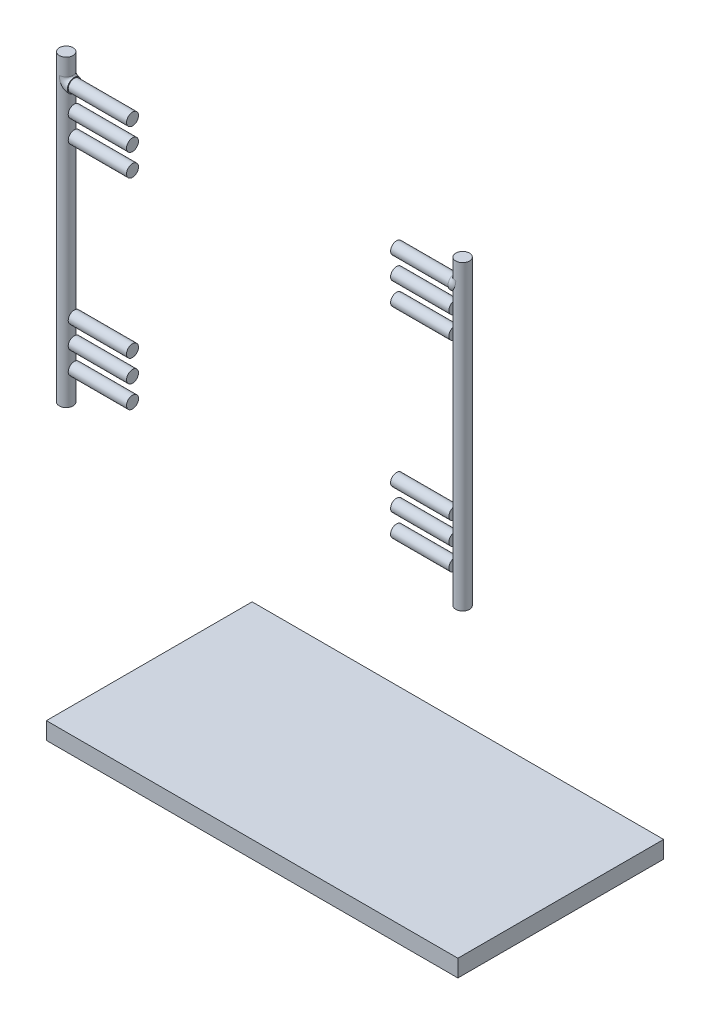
ISO-10303-21;
HEADER;
FILE_DESCRIPTION(('STEP AP214'),'2;1');
FILE_NAME('part.step','',(''),(''),'','','');
FILE_SCHEMA(('AUTOMOTIVE_DESIGN { 1 0 10303 214 1 1 1 1 }'));
ENDSEC;
DATA;
#1=APPLICATION_CONTEXT('core data for automotive mechanical design processes');
#2=APPLICATION_PROTOCOL_DEFINITION('international standard','automotive_design',2000,#1);
#3=PRODUCT_CONTEXT('',#1,'mechanical');
#4=PRODUCT('Part','Part','',(#3));
#5=PRODUCT_RELATED_PRODUCT_CATEGORY('part','',(#4));
#6=PRODUCT_DEFINITION_FORMATION('','',#4);
#7=PRODUCT_DEFINITION_CONTEXT('part definition',#1,'design');
#8=PRODUCT_DEFINITION('design','',#6,#7);
#9=PRODUCT_DEFINITION_SHAPE('','',#8);
#10=(LENGTH_UNIT() NAMED_UNIT(*) SI_UNIT(.MILLI.,.METRE.));
#11=(NAMED_UNIT(*) PLANE_ANGLE_UNIT() SI_UNIT($,.RADIAN.));
#12=(NAMED_UNIT(*) SI_UNIT($,.STERADIAN.) SOLID_ANGLE_UNIT());
#13=UNCERTAINTY_MEASURE_WITH_UNIT(LENGTH_MEASURE(1.E-05),#10,'distance_accuracy_value','');
#14=(GEOMETRIC_REPRESENTATION_CONTEXT(3) GLOBAL_UNCERTAINTY_ASSIGNED_CONTEXT((#13)) GLOBAL_UNIT_ASSIGNED_CONTEXT((#10,
#11,#12)) REPRESENTATION_CONTEXT('',''));
#15=CARTESIAN_POINT('',(0.,0.,0.));
#16=DIRECTION('',(0.,0.,1.));
#17=DIRECTION('',(1.,0.,0.));
#18=AXIS2_PLACEMENT_3D('',#15,#16,#17);
#19=CARTESIAN_POINT('',(-217.721189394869,-946.549259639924,33.515710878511));
#20=DIRECTION('',(1.,0.,0.));
#21=DIRECTION('',(0.,1.,0.));
#22=AXIS2_PLACEMENT_3D('',#19,#20,#21);
#23=PLANE('',#22);
#24=DIRECTION('',(0.,0.,-1.));
#25=VECTOR('',#24,1.);
#26=CARTESIAN_POINT('',(-217.721189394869,-896.549259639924,33.515710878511));
#27=LINE('',#26,#25);
#28=CARTESIAN_POINT('',(-217.721189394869,-896.549259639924,33.515710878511));
#29=VERTEX_POINT('',#28);
#30=CARTESIAN_POINT('',(-217.721189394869,-896.549259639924,-566.484289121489));
#31=VERTEX_POINT('',#30);
#32=EDGE_CURVE('E107',#29,#31,#27,.T.);
#33=ORIENTED_EDGE('',*,*,#32,.T.);
#34=DIRECTION('',(0.,1.,0.));
#35=VECTOR('',#34,1.);
#36=CARTESIAN_POINT('',(-217.721189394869,-946.549259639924,-566.484289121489));
#37=LINE('',#36,#35);
#38=CARTESIAN_POINT('',(-217.721189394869,-946.549259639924,-566.484289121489));
#39=VERTEX_POINT('',#38);
#40=EDGE_CURVE('E12',#39,#31,#37,.T.);
#41=ORIENTED_EDGE('',*,*,#40,.F.);
#42=DIRECTION('',(0.,0.,-1.));
#43=VECTOR('',#42,1.);
#44=CARTESIAN_POINT('',(-217.721189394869,-946.549259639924,33.515710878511));
#45=LINE('',#44,#43);
#46=CARTESIAN_POINT('',(-217.721189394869,-946.549259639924,33.515710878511));
#47=VERTEX_POINT('',#46);
#48=EDGE_CURVE('E95',#47,#39,#45,.T.);
#49=ORIENTED_EDGE('',*,*,#48,.F.);
#50=DIRECTION('',(0.,1.,0.));
#51=VECTOR('',#50,1.);
#52=CARTESIAN_POINT('',(-217.721189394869,-946.549259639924,33.515710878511));
#53=LINE('',#52,#51);
#54=EDGE_CURVE('E103',#47,#29,#53,.T.);
#55=ORIENTED_EDGE('',*,*,#54,.T.);
#56=EDGE_LOOP('',(#33,#41,#49,#55));
#57=FACE_BOUND('',#56,.T.);
#58=ADVANCED_FACE('F44',(#57),#23,.F.);
#59=CARTESIAN_POINT('',(-217.721189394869,-946.549259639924,-566.484289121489));
#60=DIRECTION('',(0.,0.,1.));
#61=DIRECTION('',(1.,0.,0.));
#62=AXIS2_PLACEMENT_3D('',#59,#60,#61);
#63=PLANE('',#62);
#64=DIRECTION('',(1.,0.,0.));
#65=VECTOR('',#64,1.);
#66=CARTESIAN_POINT('',(-217.721189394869,-896.549259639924,-566.484289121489));
#67=LINE('',#66,#65);
#68=CARTESIAN_POINT('',(982.278810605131,-896.549259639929,-566.484289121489));
#69=VERTEX_POINT('',#68);
#70=EDGE_CURVE('E99',#31,#69,#67,.T.);
#71=ORIENTED_EDGE('',*,*,#70,.T.);
#72=DIRECTION('',(0.,1.,0.));
#73=VECTOR('',#72,1.);
#74=CARTESIAN_POINT('',(982.278810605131,-946.549259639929,-566.484289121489));
#75=LINE('',#74,#73);
#76=CARTESIAN_POINT('',(982.278810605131,-946.549259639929,-566.484289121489));
#77=VERTEX_POINT('',#76);
#78=EDGE_CURVE('E52',#77,#69,#75,.T.);
#79=ORIENTED_EDGE('',*,*,#78,.F.);
#80=DIRECTION('',(1.,0.,0.));
#81=VECTOR('',#80,1.);
#82=CARTESIAN_POINT('',(-217.721189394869,-946.549259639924,-566.484289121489));
#83=LINE('',#82,#81);
#84=EDGE_CURVE('E90',#39,#77,#83,.T.);
#85=ORIENTED_EDGE('',*,*,#84,.F.);
#86=ORIENTED_EDGE('',*,*,#40,.T.);
#87=EDGE_LOOP('',(#71,#79,#85,#86));
#88=FACE_BOUND('',#87,.T.);
#89=ADVANCED_FACE('F98',(#88),#63,.F.);
#90=CARTESIAN_POINT('',(982.278810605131,-946.549259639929,33.515710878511));
#91=DIRECTION('',(-1.,0.,0.));
#92=DIRECTION('',(0.,-1.,0.));
#93=AXIS2_PLACEMENT_3D('',#90,#91,#92);
#94=PLANE('',#93);
#95=DIRECTION('',(0.,0.,1.));
#96=VECTOR('',#95,1.);
#97=CARTESIAN_POINT('',(982.278810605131,-896.549259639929,33.515710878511));
#98=LINE('',#97,#96);
#99=CARTESIAN_POINT('',(982.278810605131,-896.549259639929,33.515710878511));
#100=VERTEX_POINT('',#99);
#101=EDGE_CURVE('E77',#69,#100,#98,.T.);
#102=ORIENTED_EDGE('',*,*,#101,.T.);
#103=DIRECTION('',(0.,1.,0.));
#104=VECTOR('',#103,1.);
#105=CARTESIAN_POINT('',(982.278810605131,-946.549259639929,33.515710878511));
#106=LINE('',#105,#104);
#107=CARTESIAN_POINT('',(982.278810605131,-946.549259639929,33.515710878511));
#108=VERTEX_POINT('',#107);
#109=EDGE_CURVE('E100',#108,#100,#106,.T.);
#110=ORIENTED_EDGE('',*,*,#109,.F.);
#111=DIRECTION('',(0.,0.,1.));
#112=VECTOR('',#111,1.);
#113=CARTESIAN_POINT('',(982.278810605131,-946.549259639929,33.515710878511));
#114=LINE('',#113,#112);
#115=EDGE_CURVE('E93',#77,#108,#114,.T.);
#116=ORIENTED_EDGE('',*,*,#115,.F.);
#117=ORIENTED_EDGE('',*,*,#78,.T.);
#118=EDGE_LOOP('',(#102,#110,#116,#117));
#119=FACE_BOUND('',#118,.T.);
#120=ADVANCED_FACE('F101',(#119),#94,.F.);
#121=CARTESIAN_POINT('',(-217.721189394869,-946.549259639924,33.515710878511));
#122=DIRECTION('',(0.,0.,-1.));
#123=DIRECTION('',(-1.,0.,0.));
#124=AXIS2_PLACEMENT_3D('',#121,#122,#123);
#125=PLANE('',#124);
#126=DIRECTION('',(-1.,0.,0.));
#127=VECTOR('',#126,1.);
#128=CARTESIAN_POINT('',(-217.721189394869,-896.549259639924,33.515710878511));
#129=LINE('',#128,#127);
#130=EDGE_CURVE('E83',#100,#29,#129,.T.);
#131=ORIENTED_EDGE('',*,*,#130,.T.);
#132=ORIENTED_EDGE('',*,*,#54,.F.);
#133=DIRECTION('',(-1.,0.,0.));
#134=VECTOR('',#133,1.);
#135=CARTESIAN_POINT('',(-217.721189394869,-946.549259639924,33.515710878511));
#136=LINE('',#135,#134);
#137=EDGE_CURVE('E60',#108,#47,#136,.T.);
#138=ORIENTED_EDGE('',*,*,#137,.F.);
#139=ORIENTED_EDGE('',*,*,#109,.T.);
#140=EDGE_LOOP('',(#131,#132,#138,#139));
#141=FACE_BOUND('',#140,.T.);
#142=ADVANCED_FACE('F114',(#141),#125,.F.);
#143=CARTESIAN_POINT('',(-3.30496482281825E-12,-946.549259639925,0.));
#144=DIRECTION('',(0.,-1.,0.));
#145=DIRECTION('',(1.,0.,0.));
#146=AXIS2_PLACEMENT_3D('',#143,#144,#145);
#147=PLANE('',#146);
#148=ORIENTED_EDGE('',*,*,#48,.T.);
#149=ORIENTED_EDGE('',*,*,#84,.T.);
#150=ORIENTED_EDGE('',*,*,#115,.T.);
#151=ORIENTED_EDGE('',*,*,#137,.T.);
#152=EDGE_LOOP('',(#148,#149,#150,#151));
#153=FACE_BOUND('',#152,.T.);
#154=ADVANCED_FACE('F91',(#153),#147,.T.);
#155=CARTESIAN_POINT('',(-3.1303907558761E-12,-896.549259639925,0.));
#156=DIRECTION('',(0.,-1.,0.));
#157=DIRECTION('',(1.,0.,0.));
#158=AXIS2_PLACEMENT_3D('',#155,#156,#157);
#159=PLANE('',#158);
#160=ORIENTED_EDGE('',*,*,#32,.F.);
#161=ORIENTED_EDGE('',*,*,#130,.F.);
#162=ORIENTED_EDGE('',*,*,#101,.F.);
#163=ORIENTED_EDGE('',*,*,#70,.F.);
#164=EDGE_LOOP('',(#160,#161,#162,#163));
#165=FACE_BOUND('',#164,.T.);
#166=ADVANCED_FACE('F117',(#165),#159,.F.);
#167=CLOSED_SHELL('',(#58,#89,#120,#142,#154,#166));
#168=MANIFOLD_SOLID_BREP('B2',#167);
#169=CARTESIAN_POINT('',(940.,775.,0.));
#170=DIRECTION('',(-1.,0.,0.));
#171=DIRECTION('',(0.,0.,1.));
#172=AXIS2_PLACEMENT_3D('',#169,#170,#171);
#173=CYLINDRICAL_SURFACE('',#172,17.5);
#174=CARTESIAN_POINT('',(940.,775.,0.));
#175=DIRECTION('',(1.,0.,0.));
#176=DIRECTION('',(0.,0.,-1.));
#177=AXIS2_PLACEMENT_3D('',#174,#175,#176);
#178=CIRCLE('',#177,17.5);
#179=CARTESIAN_POINT('',(940.,775.,-17.5));
#180=VERTEX_POINT('',#179);
#181=EDGE_CURVE('E42',#180,#180,#178,.T.);
#182=ORIENTED_EDGE('',*,*,#181,.F.);
#183=EDGE_LOOP('',(#182));
#184=FACE_BOUND('',#183,.T.);
#185=CARTESIAN_POINT('',(770.,775.,0.));
#186=DIRECTION('',(1.,0.,0.));
#187=DIRECTION('',(0.,0.,-1.));
#188=AXIS2_PLACEMENT_3D('',#185,#186,#187);
#189=CIRCLE('',#188,17.5);
#190=CARTESIAN_POINT('',(770.,775.,-17.5));
#191=VERTEX_POINT('',#190);
#192=EDGE_CURVE('E178',#191,#191,#189,.T.);
#193=ORIENTED_EDGE('',*,*,#192,.T.);
#194=EDGE_LOOP('',(#193));
#195=FACE_BOUND('',#194,.T.);
#196=ADVANCED_FACE('F175',(#184,#195),#173,.T.);
#197=CARTESIAN_POINT('',(770.,775.,0.));
#198=DIRECTION('',(1.,0.,0.));
#199=DIRECTION('',(0.,0.,-1.));
#200=AXIS2_PLACEMENT_3D('',#197,#198,#199);
#201=PLANE('',#200);
#202=ORIENTED_EDGE('',*,*,#192,.F.);
#203=EDGE_LOOP('',(#202));
#204=FACE_BOUND('',#203,.T.);
#205=ADVANCED_FACE('F220',(#204),#201,.F.);
#206=CARTESIAN_POINT('',(940.,775.,0.));
#207=DIRECTION('',(1.,0.,0.));
#208=DIRECTION('',(0.,0.,-1.));
#209=AXIS2_PLACEMENT_3D('',#206,#207,#208);
#210=PLANE('',#209);
#211=CARTESIAN_POINT('',(940.,775.,0.));
#212=DIRECTION('',(1.,0.,0.));
#213=DIRECTION('',(0.,0.,-1.));
#214=AXIS2_PLACEMENT_3D('',#211,#212,#213);
#215=CIRCLE('',#214,20.);
#216=CARTESIAN_POINT('',(940.,775.,-20.));
#217=VERTEX_POINT('',#216);
#218=EDGE_CURVE('E194',#217,#217,#215,.T.);
#219=ORIENTED_EDGE('',*,*,#218,.F.);
#220=EDGE_LOOP('',(#219));
#221=FACE_BOUND('',#220,.T.);
#222=ORIENTED_EDGE('',*,*,#181,.T.);
#223=EDGE_LOOP('',(#222));
#224=FACE_BOUND('',#223,.T.);
#225=ADVANCED_FACE('F218',(#221,#224),#210,.F.);
#226=CARTESIAN_POINT('',(940.,797.631376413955,0.));
#227=DIRECTION('',(0.,0.,-1.));
#228=DIRECTION('',(-1.,0.,0.));
#229=AXIS2_PLACEMENT_3D('',#226,#227,#228);
#230=TOROIDAL_SURFACE('',#229,22.6313764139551,20.);
#231=CARTESIAN_POINT('',(962.631376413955,797.631376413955,0.));
#232=DIRECTION('',(0.,1.,0.));
#233=DIRECTION('',(0.,0.,-1.));
#234=AXIS2_PLACEMENT_3D('',#231,#232,#233);
#235=CIRCLE('',#234,20.);
#236=CARTESIAN_POINT('',(962.631376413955,797.631376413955,-20.0000000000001));
#237=VERTEX_POINT('',#236);
#238=CARTESIAN_POINT('',(962.631376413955,797.631376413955,20.0000000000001));
#239=VERTEX_POINT('',#238);
#240=EDGE_CURVE('E188',#237,#239,#235,.T.);
#241=ORIENTED_EDGE('',*,*,#240,.F.);
#242=CARTESIAN_POINT('',(962.631376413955,797.631376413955,-20.));
#243=CARTESIAN_POINT('',(962.631376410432,797.560459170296,-20.0000000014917));
#244=CARTESIAN_POINT('',(962.631209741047,797.489542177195,-20.000000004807));
#245=CARTESIAN_POINT('',(962.630557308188,797.350735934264,-19.9999999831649));
#246=CARTESIAN_POINT('',(962.63008546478,797.282846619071,-19.9999999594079));
#247=CARTESIAN_POINT('',(962.626962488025,796.943395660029,-19.9999997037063));
#248=CARTESIAN_POINT('',(962.622020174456,796.671851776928,-19.9999990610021));
#249=CARTESIAN_POINT('',(962.605502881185,796.064535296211,-19.9999854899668));
#250=CARTESIAN_POINT('',(962.592633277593,795.728797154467,-19.999969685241));
#251=CARTESIAN_POINT('',(962.561636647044,795.101925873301,-19.9998833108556));
#252=CARTESIAN_POINT('',(962.544426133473,794.810746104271,-19.9998202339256));
#253=CARTESIAN_POINT('',(962.484380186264,793.937325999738,-19.9995014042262));
#254=CARTESIAN_POINT('',(962.433143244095,793.355631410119,-19.9991159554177));
#255=CARTESIAN_POINT('',(962.339719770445,792.484853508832,-19.9978968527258));
#256=CARTESIAN_POINT('',(962.305811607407,792.194849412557,-19.9973835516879));
#257=CARTESIAN_POINT('',(962.232519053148,791.615507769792,-19.9960560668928));
#258=CARTESIAN_POINT('',(962.19313419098,791.326170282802,-19.9952418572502));
#259=CARTESIAN_POINT('',(962.065903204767,790.452855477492,-19.9921867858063));
#260=CARTESIAN_POINT('',(961.96967894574,789.87007961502,-19.9893384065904));
#261=CARTESIAN_POINT('',(961.755595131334,788.70848660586,-19.9811026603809));
#262=CARTESIAN_POINT('',(961.637733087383,788.129669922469,-19.9757150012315));
#263=CARTESIAN_POINT('',(961.380972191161,786.97651875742,-19.9612885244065));
#264=CARTESIAN_POINT('',(961.242065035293,786.402186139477,-19.9522482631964));
#265=CARTESIAN_POINT('',(960.943990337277,785.258889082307,-19.929250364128));
#266=CARTESIAN_POINT('',(960.784821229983,784.68992506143,-19.9152923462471));
#267=CARTESIAN_POINT('',(960.277116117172,782.988683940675,-19.8638816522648));
#268=CARTESIAN_POINT('',(959.899115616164,781.865320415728,-19.8169177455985));
#269=CARTESIAN_POINT('',(959.072292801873,779.647554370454,-19.6852212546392));
#270=CARTESIAN_POINT('',(958.623481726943,778.553147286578,-19.6004946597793));
#271=CARTESIAN_POINT('',(957.661485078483,776.392893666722,-19.3789789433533));
#272=CARTESIAN_POINT('',(957.148044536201,775.327181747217,-19.241978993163));
#273=CARTESIAN_POINT('',(956.067942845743,773.233546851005,-18.9008505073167));
#274=CARTESIAN_POINT('',(955.501266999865,772.205634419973,-18.6967033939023));
#275=CARTESIAN_POINT('',(954.32848781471,770.197304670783,-18.2061769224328));
#276=CARTESIAN_POINT('',(953.722521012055,769.216741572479,-17.9200716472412));
#277=CARTESIAN_POINT('',(952.48395013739,767.307956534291,-17.2489222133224));
#278=CARTESIAN_POINT('',(951.85136926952,766.37969058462,-16.8639628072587));
#279=CARTESIAN_POINT('',(950.869919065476,764.997831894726,-16.1816000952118));
#280=CARTESIAN_POINT('',(950.523984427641,764.521786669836,-15.9250096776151));
#281=CARTESIAN_POINT('',(949.833106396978,763.590424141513,-15.3752778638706));
#282=CARTESIAN_POINT('',(949.488162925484,763.135105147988,-15.0821394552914));
#283=CARTESIAN_POINT('',(948.803490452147,762.248145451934,-14.4569836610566));
#284=CARTESIAN_POINT('',(948.463759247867,761.81649453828,-14.124983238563));
#285=CARTESIAN_POINT('',(947.794103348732,760.979957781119,-13.4198228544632));
#286=CARTESIAN_POINT('',(947.464177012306,760.575067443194,-13.0466698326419));
#287=CARTESIAN_POINT('',(946.87775071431,759.866220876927,-12.3287319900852));
#288=CARTESIAN_POINT('',(946.618739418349,759.557230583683,-11.9909679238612));
#289=CARTESIAN_POINT('',(946.114369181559,758.96228159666,-11.2861076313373));
#290=CARTESIAN_POINT('',(945.869009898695,758.676322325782,-10.9190121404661));
#291=CARTESIAN_POINT('',(945.395943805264,758.130481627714,-10.1558462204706));
#292=CARTESIAN_POINT('',(945.168219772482,757.870574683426,-9.75980481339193));
#293=CARTESIAN_POINT('',(944.734235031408,757.379568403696,-8.93910755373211));
#294=CARTESIAN_POINT('',(944.527969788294,757.148462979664,-8.51445777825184));
#295=CARTESIAN_POINT('',(944.178569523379,756.759872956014,-7.72290074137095));
#296=CARTESIAN_POINT('',(944.030940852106,756.596794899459,-7.3607138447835));
#297=CARTESIAN_POINT('',(943.754646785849,756.293155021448,-6.62006186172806));
#298=CARTESIAN_POINT('',(943.625977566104,756.152588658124,-6.24160007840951));
#299=CARTESIAN_POINT('',(943.389779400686,755.895638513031,-5.47024467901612));
#300=CARTESIAN_POINT('',(943.282244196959,755.779247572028,-5.07735537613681));
#301=CARTESIAN_POINT('',(943.090245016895,755.572114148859,-4.27932117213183));
#302=CARTESIAN_POINT('',(943.005781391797,755.481372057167,-3.8741760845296));
#303=CARTESIAN_POINT('',(942.861226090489,755.326425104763,-3.05224097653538));
#304=CARTESIAN_POINT('',(942.801266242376,755.262363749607,-2.63540053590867));
#305=CARTESIAN_POINT('',(942.707644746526,755.162465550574,-1.79540740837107));
#306=CARTESIAN_POINT('',(942.673983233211,755.126628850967,-1.37225468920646));
#307=CARTESIAN_POINT('',(942.633708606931,755.083762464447,-0.523293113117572));
#308=CARTESIAN_POINT('',(942.62708989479,755.076726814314,-0.0974848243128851));
#309=CARTESIAN_POINT('',(942.641037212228,755.091564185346,0.753162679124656));
#310=CARTESIAN_POINT('',(942.661601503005,755.11343535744,1.17800195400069));
#311=CARTESIAN_POINT('',(942.726502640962,755.182585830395,1.98644543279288));
#312=CARTESIAN_POINT('',(942.76862658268,755.227500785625,2.37043451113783));
#313=CARTESIAN_POINT('',(942.874385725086,755.340540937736,3.1319432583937));
#314=CARTESIAN_POINT('',(942.938019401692,755.408664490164,3.50946338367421));
#315=CARTESIAN_POINT('',(943.085690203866,755.567265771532,4.25568226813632));
#316=CARTESIAN_POINT('',(943.169727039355,755.657743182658,4.62438115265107));
#317=CARTESIAN_POINT('',(943.356828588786,755.859993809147,5.35093971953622));
#318=CARTESIAN_POINT('',(943.459894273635,755.971768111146,5.70879884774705));
#319=CARTESIAN_POINT('',(943.687908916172,756.220230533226,6.42589634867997));
#320=CARTESIAN_POINT('',(943.813562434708,756.357729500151,6.78462893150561));
#321=CARTESIAN_POINT('',(944.08183530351,756.652987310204,7.48704839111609));
#322=CARTESIAN_POINT('',(944.224454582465,756.810746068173,7.83073533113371));
#323=CARTESIAN_POINT('',(944.5247591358,757.145099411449,8.50209852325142));
#324=CARTESIAN_POINT('',(944.682448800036,757.321699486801,8.82977006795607));
#325=CARTESIAN_POINT('',(945.010940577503,757.692257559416,9.46832775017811));
#326=CARTESIAN_POINT('',(945.181745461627,757.886219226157,9.77921031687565));
#327=CARTESIAN_POINT('',(945.621249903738,758.38929599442,10.5322295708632));
#328=CARTESIAN_POINT('',(945.896838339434,758.708191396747,10.9638651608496));
#329=CARTESIAN_POINT('',(946.467191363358,759.377187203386,11.7885856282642));
#330=CARTESIAN_POINT('',(946.761963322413,759.727299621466,12.1816555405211));
#331=CARTESIAN_POINT('',(947.365931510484,760.455512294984,12.9305052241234));
#332=CARTESIAN_POINT('',(947.675151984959,760.83366026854,13.2862188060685));
#333=CARTESIAN_POINT('',(948.302876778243,761.614060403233,13.9608899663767));
#334=CARTESIAN_POINT('',(948.621381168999,762.016312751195,14.2798472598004));
#335=CARTESIAN_POINT('',(949.406171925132,763.025405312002,15.0166051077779));
#336=CARTESIAN_POINT('',(949.875344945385,763.643852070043,15.4154962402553));
#337=CARTESIAN_POINT('',(950.814470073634,764.918411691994,16.1466761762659));
#338=CARTESIAN_POINT('',(951.284422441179,765.57454179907,16.4789341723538));
#339=CARTESIAN_POINT('',(952.217250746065,766.919863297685,17.0837744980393));
#340=CARTESIAN_POINT('',(952.680116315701,767.609097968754,17.3562759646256));
#341=CARTESIAN_POINT('',(953.591119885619,769.015499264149,17.8477336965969));
#342=CARTESIAN_POINT('',(954.039259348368,769.732663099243,18.0666952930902));
#343=CARTESIAN_POINT('',(954.991704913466,771.319408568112,18.491971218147));
#344=CARTESIAN_POINT('',(955.492122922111,772.193707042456,18.6893727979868));
#345=CARTESIAN_POINT('',(956.456788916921,773.972361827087,19.0298747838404));
#346=CARTESIAN_POINT('',(956.921029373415,774.876724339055,19.1729639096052));
#347=CARTESIAN_POINT('',(957.806036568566,776.711129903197,19.414589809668));
#348=CARTESIAN_POINT('',(958.226844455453,777.641147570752,19.5131690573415));
#349=CARTESIAN_POINT('',(959.01943223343,779.524477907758,19.6753000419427));
#350=CARTESIAN_POINT('',(959.391224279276,780.477784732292,19.7388604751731));
#351=CARTESIAN_POINT('',(960.100514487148,782.460813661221,19.8426480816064));
#352=CARTESIAN_POINT('',(960.434801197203,783.491773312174,19.8813193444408));
#353=CARTESIAN_POINT('',(960.886477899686,785.052481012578,19.9243079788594));
#354=CARTESIAN_POINT('',(961.028715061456,785.574961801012,19.936133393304));
#355=CARTESIAN_POINT('',(961.296072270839,786.624364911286,19.9558251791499));
#356=CARTESIAN_POINT('',(961.421192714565,787.151287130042,19.96369164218));
#357=CARTESIAN_POINT('',(961.681037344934,788.333189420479,19.9779270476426));
#358=CARTESIAN_POINT('',(961.811125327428,788.989204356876,19.9835114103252));
#359=CARTESIAN_POINT('',(962.043409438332,790.306103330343,19.9916924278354));
#360=CARTESIAN_POINT('',(962.145607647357,790.966987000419,19.9942893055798));
#361=CARTESIAN_POINT('',(962.343073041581,792.456290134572,19.9982269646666));
#362=CARTESIAN_POINT('',(962.430398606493,793.285785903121,19.9990992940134));
#363=CARTESIAN_POINT('',(962.534221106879,794.622861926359,19.9997995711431));
#364=CARTESIAN_POINT('',(962.565062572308,795.129372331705,19.9999026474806));
#365=CARTESIAN_POINT('',(962.600537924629,795.934191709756,19.9999804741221));
#366=CARTESIAN_POINT('',(962.610734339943,796.232260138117,19.9999906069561));
#367=CARTESIAN_POINT('',(962.62518678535,796.826425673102,20.0000003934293));
#368=CARTESIAN_POINT('',(962.629484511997,797.122521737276,20.0000001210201));
#369=CARTESIAN_POINT('',(962.631209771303,797.489542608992,19.999999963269));
#370=CARTESIAN_POINT('',(962.631376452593,797.560459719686,19.9999999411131));
#371=CARTESIAN_POINT('',(962.631376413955,797.631376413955,20.));
#372=B_SPLINE_CURVE_WITH_KNOTS('',3,(#242,#243,#244,#245,#246,#247,#248,#249,#250,#251,#252,
#253,#254,#255,#256,#257,#258,#259,#260,#261,#262,#263,#264,#265,#266,#267,#268,#269,#270,#271,
#272,#273,#274,#275,#276,#277,#278,#279,#280,#281,#282,#283,#284,#285,#286,#287,#288,#289,#290,
#291,#292,#293,#294,#295,#296,#297,#298,#299,#300,#301,#302,#303,#304,#305,#306,#307,#308,#309,
#310,#311,#312,#313,#314,#315,#316,#317,#318,#319,#320,#321,#322,#323,#324,#325,#326,#327,#328,
#329,#330,#331,#332,#333,#334,#335,#336,#337,#338,#339,#340,#341,#342,#343,#344,#345,#346,#347,
#348,#349,#350,#351,#352,#353,#354,#355,#356,#357,#358,#359,#360,#361,#362,#363,#364,#365,#366,
#367,#368,#369,#370,#371),.UNSPECIFIED.,.F.,.F.,(4,2,2,2,2,2,2,2,2,2,2,2,2,2,2,2,2,2,2,2,2,2,2,
2,2,2,2,2,2,2,2,2,2,2,2,2,2,2,2,2,2,2,2,2,2,2,2,2,2,2,2,2,2,2,2,2,2,2,2,2,2,2,2,2,4),(0.,
0.212751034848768,0.416423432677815,1.23114393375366,2.23900766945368,3.1140321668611,
4.86536057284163,5.74125985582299,6.61723450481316,8.38879453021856,10.1605584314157,
11.9330232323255,13.7056250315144,17.2608374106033,20.8154861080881,24.3846255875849,
27.954753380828,31.5130786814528,35.068363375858,36.993143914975,38.9177672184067,
40.8415535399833,42.7650159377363,44.3415866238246,45.9181177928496,47.4930894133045,
49.0677275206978,50.337766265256,51.6075484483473,52.8769540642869,54.1463790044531,
55.4225461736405,56.6987198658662,57.9746293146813,59.2504571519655,60.4157992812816,
61.5810588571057,62.7463018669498,63.9116043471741,65.1230194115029,66.3344293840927,
67.5461933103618,68.75821395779,70.5653297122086,72.3731439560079,74.1841091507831,
75.9950883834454,78.6093350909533,81.2247877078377,83.8437580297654,86.4624674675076,
89.5392685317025,92.6167082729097,95.6912051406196,98.7649381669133,102.015822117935,
103.640447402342,105.265035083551,107.270849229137,109.276513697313,111.777390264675,
113.299470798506,114.194145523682,115.082462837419,115.295213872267),.UNSPECIFIED.);
#373=EDGE_CURVE('E190',#237,#239,#372,.T.);
#374=ORIENTED_EDGE('',*,*,#373,.T.);
#375=EDGE_LOOP('',(#241,#374));
#376=FACE_BOUND('',#375,.T.);
#377=ORIENTED_EDGE('',*,*,#218,.T.);
#378=EDGE_LOOP('',(#377));
#379=FACE_BOUND('',#378,.T.);
#380=ADVANCED_FACE('F191',(#376,#379),#230,.T.);
#381=CARTESIAN_POINT('',(962.631376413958,-32.3686235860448,0.));
#382=DIRECTION('',(0.,1.,0.));
#383=DIRECTION('',(-1.,0.,0.));
#384=AXIS2_PLACEMENT_3D('',#381,#382,#383);
#385=CYLINDRICAL_SURFACE('',#384,20.0000000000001);
#386=CARTESIAN_POINT('',(962.631376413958,-32.3686235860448,0.));
#387=DIRECTION('',(0.,1.,0.));
#388=DIRECTION('',(-1.,0.,0.));
#389=AXIS2_PLACEMENT_3D('',#386,#387,#388);
#390=CIRCLE('',#389,20.0000000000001);
#391=CARTESIAN_POINT('',(942.631376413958,-32.3686235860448,0.));
#392=VERTEX_POINT('',#391);
#393=EDGE_CURVE('E195',#392,#392,#390,.T.);
#394=ORIENTED_EDGE('',*,*,#393,.T.);
#395=EDGE_LOOP('',(#394));
#396=FACE_BOUND('',#395,.T.);
#397=ORIENTED_EDGE('',*,*,#373,.F.);
#398=ORIENTED_EDGE('',*,*,#240,.T.);
#399=EDGE_LOOP('',(#397,#398));
#400=FACE_BOUND('',#399,.T.);
#401=CARTESIAN_POINT('',(962.631376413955,847.631376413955,0.));
#402=DIRECTION('',(0.,1.,0.));
#403=DIRECTION('',(-1.,0.,0.));
#404=AXIS2_PLACEMENT_3D('',#401,#402,#403);
#405=CIRCLE('',#404,20.0000000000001);
#406=CARTESIAN_POINT('',(942.631376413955,847.631376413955,0.));
#407=VERTEX_POINT('',#406);
#408=EDGE_CURVE('E279',#407,#407,#405,.T.);
#409=ORIENTED_EDGE('',*,*,#408,.F.);
#410=EDGE_LOOP('',(#409));
#411=FACE_BOUND('',#410,.T.);
#412=ADVANCED_FACE('F197',(#396,#400,#411),#385,.T.);
#413=CARTESIAN_POINT('',(962.631376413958,-32.3686235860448,0.));
#414=DIRECTION('',(0.,1.,0.));
#415=DIRECTION('',(-1.,0.,0.));
#416=AXIS2_PLACEMENT_3D('',#413,#414,#415);
#417=PLANE('',#416);
#418=ORIENTED_EDGE('',*,*,#393,.F.);
#419=EDGE_LOOP('',(#418));
#420=FACE_BOUND('',#419,.T.);
#421=ADVANCED_FACE('F215',(#420),#417,.F.);
#422=CARTESIAN_POINT('',(962.631376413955,847.631376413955,0.));
#423=DIRECTION('',(0.,1.,0.));
#424=DIRECTION('',(-1.,0.,0.));
#425=AXIS2_PLACEMENT_3D('',#422,#423,#424);
#426=PLANE('',#425);
#427=ORIENTED_EDGE('',*,*,#408,.T.);
#428=EDGE_LOOP('',(#427));
#429=FACE_BOUND('',#428,.T.);
#430=ADVANCED_FACE('F265',(#429),#426,.T.);
#431=CLOSED_SHELL('',(#196,#205,#225,#380,#412,#421,#430));
#432=MANIFOLD_SOLID_BREP('B6',#431);
#433=CARTESIAN_POINT('',(940.,710.,0.));
#434=DIRECTION('',(-1.,0.,0.));
#435=DIRECTION('',(0.,0.,1.));
#436=AXIS2_PLACEMENT_3D('',#433,#434,#435);
#437=CYLINDRICAL_SURFACE('',#436,17.5);
#438=CARTESIAN_POINT('',(940.,710.,0.));
#439=DIRECTION('',(1.,0.,0.));
#440=DIRECTION('',(0.,0.,-1.));
#441=AXIS2_PLACEMENT_3D('',#438,#439,#440);
#442=CIRCLE('',#441,17.5);
#443=CARTESIAN_POINT('',(940.,710.,-17.5));
#444=VERTEX_POINT('',#443);
#445=EDGE_CURVE('E174',#444,#444,#442,.T.);
#446=ORIENTED_EDGE('',*,*,#445,.F.);
#447=EDGE_LOOP('',(#446));
#448=FACE_BOUND('',#447,.T.);
#449=CARTESIAN_POINT('',(770.,710.,0.));
#450=DIRECTION('',(1.,0.,0.));
#451=DIRECTION('',(0.,0.,-1.));
#452=AXIS2_PLACEMENT_3D('',#449,#450,#451);
#453=CIRCLE('',#452,17.5);
#454=CARTESIAN_POINT('',(770.,710.,-17.5));
#455=VERTEX_POINT('',#454);
#456=EDGE_CURVE('E297',#455,#455,#453,.T.);
#457=ORIENTED_EDGE('',*,*,#456,.T.);
#458=EDGE_LOOP('',(#457));
#459=FACE_BOUND('',#458,.T.);
#460=ADVANCED_FACE('F294',(#448,#459),#437,.T.);
#461=CARTESIAN_POINT('',(940.,710.,0.));
#462=DIRECTION('',(1.,0.,0.));
#463=DIRECTION('',(0.,0.,-1.));
#464=AXIS2_PLACEMENT_3D('',#461,#462,#463);
#465=PLANE('',#464);
#466=ORIENTED_EDGE('',*,*,#445,.T.);
#467=EDGE_LOOP('',(#466));
#468=FACE_BOUND('',#467,.T.);
#469=ADVANCED_FACE('F309',(#468),#465,.T.);
#470=CARTESIAN_POINT('',(770.,710.,0.));
#471=DIRECTION('',(1.,0.,0.));
#472=DIRECTION('',(0.,0.,-1.));
#473=AXIS2_PLACEMENT_3D('',#470,#471,#472);
#474=PLANE('',#473);
#475=ORIENTED_EDGE('',*,*,#456,.F.);
#476=EDGE_LOOP('',(#475));
#477=FACE_BOUND('',#476,.T.);
#478=ADVANCED_FACE('F307',(#477),#474,.F.);
#479=CLOSED_SHELL('',(#460,#469,#478));
#480=MANIFOLD_SOLID_BREP('B36',#479);
#481=CARTESIAN_POINT('',(940.,645.,0.));
#482=DIRECTION('',(-1.,0.,0.));
#483=DIRECTION('',(0.,0.,1.));
#484=AXIS2_PLACEMENT_3D('',#481,#482,#483);
#485=CYLINDRICAL_SURFACE('',#484,17.5);
#486=CARTESIAN_POINT('',(940.,645.,0.));
#487=DIRECTION('',(1.,0.,0.));
#488=DIRECTION('',(0.,0.,-1.));
#489=AXIS2_PLACEMENT_3D('',#486,#487,#488);
#490=CIRCLE('',#489,17.5);
#491=CARTESIAN_POINT('',(940.,645.,-17.5));
#492=VERTEX_POINT('',#491);
#493=EDGE_CURVE('E293',#492,#492,#490,.T.);
#494=ORIENTED_EDGE('',*,*,#493,.F.);
#495=EDGE_LOOP('',(#494));
#496=FACE_BOUND('',#495,.T.);
#497=CARTESIAN_POINT('',(770.,645.,0.));
#498=DIRECTION('',(1.,0.,0.));
#499=DIRECTION('',(0.,0.,-1.));
#500=AXIS2_PLACEMENT_3D('',#497,#498,#499);
#501=CIRCLE('',#500,17.5);
#502=CARTESIAN_POINT('',(770.,645.,-17.5));
#503=VERTEX_POINT('',#502);
#504=EDGE_CURVE('E345',#503,#503,#501,.T.);
#505=ORIENTED_EDGE('',*,*,#504,.T.);
#506=EDGE_LOOP('',(#505));
#507=FACE_BOUND('',#506,.T.);
#508=ADVANCED_FACE('F342',(#496,#507),#485,.T.);
#509=CARTESIAN_POINT('',(940.,645.,0.));
#510=DIRECTION('',(1.,0.,0.));
#511=DIRECTION('',(0.,0.,-1.));
#512=AXIS2_PLACEMENT_3D('',#509,#510,#511);
#513=PLANE('',#512);
#514=ORIENTED_EDGE('',*,*,#493,.T.);
#515=EDGE_LOOP('',(#514));
#516=FACE_BOUND('',#515,.T.);
#517=ADVANCED_FACE('F357',(#516),#513,.T.);
#518=CARTESIAN_POINT('',(770.,645.,0.));
#519=DIRECTION('',(1.,0.,0.));
#520=DIRECTION('',(0.,0.,-1.));
#521=AXIS2_PLACEMENT_3D('',#518,#519,#520);
#522=PLANE('',#521);
#523=ORIENTED_EDGE('',*,*,#504,.F.);
#524=EDGE_LOOP('',(#523));
#525=FACE_BOUND('',#524,.T.);
#526=ADVANCED_FACE('F355',(#525),#522,.F.);
#527=CLOSED_SHELL('',(#508,#517,#526));
#528=MANIFOLD_SOLID_BREP('B169',#527);
#529=CARTESIAN_POINT('',(940.,190.,0.));
#530=DIRECTION('',(-1.,0.,0.));
#531=DIRECTION('',(0.,0.,1.));
#532=AXIS2_PLACEMENT_3D('',#529,#530,#531);
#533=CYLINDRICAL_SURFACE('',#532,17.5);
#534=CARTESIAN_POINT('',(940.,190.,0.));
#535=DIRECTION('',(1.,0.,0.));
#536=DIRECTION('',(0.,0.,-1.));
#537=AXIS2_PLACEMENT_3D('',#534,#535,#536);
#538=CIRCLE('',#537,17.5);
#539=CARTESIAN_POINT('',(940.,190.,-17.5));
#540=VERTEX_POINT('',#539);
#541=EDGE_CURVE('E341',#540,#540,#538,.T.);
#542=ORIENTED_EDGE('',*,*,#541,.F.);
#543=EDGE_LOOP('',(#542));
#544=FACE_BOUND('',#543,.T.);
#545=CARTESIAN_POINT('',(770.,190.,0.));
#546=DIRECTION('',(1.,0.,0.));
#547=DIRECTION('',(0.,0.,-1.));
#548=AXIS2_PLACEMENT_3D('',#545,#546,#547);
#549=CIRCLE('',#548,17.5);
#550=CARTESIAN_POINT('',(770.,190.,-17.5));
#551=VERTEX_POINT('',#550);
#552=EDGE_CURVE('E393',#551,#551,#549,.T.);
#553=ORIENTED_EDGE('',*,*,#552,.T.);
#554=EDGE_LOOP('',(#553));
#555=FACE_BOUND('',#554,.T.);
#556=ADVANCED_FACE('F390',(#544,#555),#533,.T.);
#557=CARTESIAN_POINT('',(940.,190.,0.));
#558=DIRECTION('',(1.,0.,0.));
#559=DIRECTION('',(0.,0.,-1.));
#560=AXIS2_PLACEMENT_3D('',#557,#558,#559);
#561=PLANE('',#560);
#562=ORIENTED_EDGE('',*,*,#541,.T.);
#563=EDGE_LOOP('',(#562));
#564=FACE_BOUND('',#563,.T.);
#565=ADVANCED_FACE('F405',(#564),#561,.T.);
#566=CARTESIAN_POINT('',(770.,190.,0.));
#567=DIRECTION('',(1.,0.,0.));
#568=DIRECTION('',(0.,0.,-1.));
#569=AXIS2_PLACEMENT_3D('',#566,#567,#568);
#570=PLANE('',#569);
#571=ORIENTED_EDGE('',*,*,#552,.F.);
#572=EDGE_LOOP('',(#571));
#573=FACE_BOUND('',#572,.T.);
#574=ADVANCED_FACE('F403',(#573),#570,.F.);
#575=CLOSED_SHELL('',(#556,#565,#574));
#576=MANIFOLD_SOLID_BREP('B288',#575);
#577=CARTESIAN_POINT('',(940.,125.,0.));
#578=DIRECTION('',(-1.,0.,0.));
#579=DIRECTION('',(0.,0.,1.));
#580=AXIS2_PLACEMENT_3D('',#577,#578,#579);
#581=CYLINDRICAL_SURFACE('',#580,17.5);
#582=CARTESIAN_POINT('',(940.,125.,0.));
#583=DIRECTION('',(1.,0.,0.));
#584=DIRECTION('',(0.,0.,-1.));
#585=AXIS2_PLACEMENT_3D('',#582,#583,#584);
#586=CIRCLE('',#585,17.5);
#587=CARTESIAN_POINT('',(940.,125.,-17.5));
#588=VERTEX_POINT('',#587);
#589=EDGE_CURVE('E389',#588,#588,#586,.T.);
#590=ORIENTED_EDGE('',*,*,#589,.F.);
#591=EDGE_LOOP('',(#590));
#592=FACE_BOUND('',#591,.T.);
#593=CARTESIAN_POINT('',(770.,125.,0.));
#594=DIRECTION('',(1.,0.,0.));
#595=DIRECTION('',(0.,0.,-1.));
#596=AXIS2_PLACEMENT_3D('',#593,#594,#595);
#597=CIRCLE('',#596,17.5);
#598=CARTESIAN_POINT('',(770.,125.,-17.5));
#599=VERTEX_POINT('',#598);
#600=EDGE_CURVE('E441',#599,#599,#597,.T.);
#601=ORIENTED_EDGE('',*,*,#600,.T.);
#602=EDGE_LOOP('',(#601));
#603=FACE_BOUND('',#602,.T.);
#604=ADVANCED_FACE('F438',(#592,#603),#581,.T.);
#605=CARTESIAN_POINT('',(940.,125.,0.));
#606=DIRECTION('',(1.,0.,0.));
#607=DIRECTION('',(0.,0.,-1.));
#608=AXIS2_PLACEMENT_3D('',#605,#606,#607);
#609=PLANE('',#608);
#610=ORIENTED_EDGE('',*,*,#589,.T.);
#611=EDGE_LOOP('',(#610));
#612=FACE_BOUND('',#611,.T.);
#613=ADVANCED_FACE('F453',(#612),#609,.T.);
#614=CARTESIAN_POINT('',(770.,125.,0.));
#615=DIRECTION('',(1.,0.,0.));
#616=DIRECTION('',(0.,0.,-1.));
#617=AXIS2_PLACEMENT_3D('',#614,#615,#616);
#618=PLANE('',#617);
#619=ORIENTED_EDGE('',*,*,#600,.F.);
#620=EDGE_LOOP('',(#619));
#621=FACE_BOUND('',#620,.T.);
#622=ADVANCED_FACE('F451',(#621),#618,.F.);
#623=CLOSED_SHELL('',(#604,#613,#622));
#624=MANIFOLD_SOLID_BREP('B336',#623);
#625=CARTESIAN_POINT('',(940.,60.,0.));
#626=DIRECTION('',(-1.,0.,0.));
#627=DIRECTION('',(0.,0.,1.));
#628=AXIS2_PLACEMENT_3D('',#625,#626,#627);
#629=CYLINDRICAL_SURFACE('',#628,17.5);
#630=CARTESIAN_POINT('',(940.,60.,0.));
#631=DIRECTION('',(1.,0.,0.));
#632=DIRECTION('',(0.,0.,-1.));
#633=AXIS2_PLACEMENT_3D('',#630,#631,#632);
#634=CIRCLE('',#633,17.5);
#635=CARTESIAN_POINT('',(940.,60.,-17.5));
#636=VERTEX_POINT('',#635);
#637=EDGE_CURVE('E437',#636,#636,#634,.T.);
#638=ORIENTED_EDGE('',*,*,#637,.F.);
#639=EDGE_LOOP('',(#638));
#640=FACE_BOUND('',#639,.T.);
#641=CARTESIAN_POINT('',(770.,60.,0.));
#642=DIRECTION('',(1.,0.,0.));
#643=DIRECTION('',(0.,0.,-1.));
#644=AXIS2_PLACEMENT_3D('',#641,#642,#643);
#645=CIRCLE('',#644,17.5);
#646=CARTESIAN_POINT('',(770.,60.,-17.5));
#647=VERTEX_POINT('',#646);
#648=EDGE_CURVE('E491',#647,#647,#645,.T.);
#649=ORIENTED_EDGE('',*,*,#648,.T.);
#650=EDGE_LOOP('',(#649));
#651=FACE_BOUND('',#650,.T.);
#652=ADVANCED_FACE('F488',(#640,#651),#629,.T.);
#653=CARTESIAN_POINT('',(940.,60.,0.));
#654=DIRECTION('',(1.,0.,0.));
#655=DIRECTION('',(0.,0.,-1.));
#656=AXIS2_PLACEMENT_3D('',#653,#654,#655);
#657=PLANE('',#656);
#658=ORIENTED_EDGE('',*,*,#637,.T.);
#659=EDGE_LOOP('',(#658));
#660=FACE_BOUND('',#659,.T.);
#661=ADVANCED_FACE('F503',(#660),#657,.T.);
#662=CARTESIAN_POINT('',(770.,60.,0.));
#663=DIRECTION('',(1.,0.,0.));
#664=DIRECTION('',(0.,0.,-1.));
#665=AXIS2_PLACEMENT_3D('',#662,#663,#664);
#666=PLANE('',#665);
#667=ORIENTED_EDGE('',*,*,#648,.F.);
#668=EDGE_LOOP('',(#667));
#669=FACE_BOUND('',#668,.T.);
#670=ADVANCED_FACE('F501',(#669),#666,.F.);
#671=CLOSED_SHELL('',(#652,#661,#670));
#672=MANIFOLD_SOLID_BREP('B384',#671);
#673=CARTESIAN_POINT('',(-170.,715.,0.));
#674=DIRECTION('',(1.,0.,0.));
#675=DIRECTION('',(0.,0.,-1.));
#676=AXIS2_PLACEMENT_3D('',#673,#674,#675);
#677=CYLINDRICAL_SURFACE('',#676,17.5);
#678=CARTESIAN_POINT('',(-170.,715.,0.));
#679=DIRECTION('',(-1.,0.,0.));
#680=DIRECTION('',(0.,0.,1.));
#681=AXIS2_PLACEMENT_3D('',#678,#679,#680);
#682=CIRCLE('',#681,17.5);
#683=CARTESIAN_POINT('',(-170.,715.,17.5));
#684=VERTEX_POINT('',#683);
#685=EDGE_CURVE('E543',#684,#684,#682,.F.);
#686=ORIENTED_EDGE('',*,*,#685,.T.);
#687=EDGE_LOOP('',(#686));
#688=FACE_BOUND('',#687,.T.);
#689=CARTESIAN_POINT('',(0.,715.,0.));
#690=DIRECTION('',(1.,0.,0.));
#691=DIRECTION('',(0.,0.,-1.));
#692=AXIS2_PLACEMENT_3D('',#689,#690,#691);
#693=CIRCLE('',#692,17.5);
#694=CARTESIAN_POINT('',(0.,715.,-17.5));
#695=VERTEX_POINT('',#694);
#696=EDGE_CURVE('E486',#695,#695,#693,.T.);
#697=ORIENTED_EDGE('',*,*,#696,.F.);
#698=EDGE_LOOP('',(#697));
#699=FACE_BOUND('',#698,.T.);
#700=ADVANCED_FACE('F536',(#688,#699),#677,.T.);
#701=CARTESIAN_POINT('',(0.,715.,0.));
#702=DIRECTION('',(1.,0.,0.));
#703=DIRECTION('',(0.,0.,-1.));
#704=AXIS2_PLACEMENT_3D('',#701,#702,#703);
#705=PLANE('',#704);
#706=ORIENTED_EDGE('',*,*,#696,.T.);
#707=EDGE_LOOP('',(#706));
#708=FACE_BOUND('',#707,.T.);
#709=ADVANCED_FACE('F585',(#708),#705,.T.);
#710=CARTESIAN_POINT('',(-170.,738.450740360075,0.));
#711=DIRECTION('',(0.,0.,1.));
#712=DIRECTION('',(1.,0.,0.));
#713=AXIS2_PLACEMENT_3D('',#710,#711,#712);
#714=TOROIDAL_SURFACE('',#713,23.4507403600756,20.);
#715=CARTESIAN_POINT('',(-193.450740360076,738.450740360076,0.));
#716=DIRECTION('',(0.,1.,0.));
#717=DIRECTION('',(0.,0.,1.));
#718=AXIS2_PLACEMENT_3D('',#715,#716,#717);
#719=CIRCLE('',#718,20.);
#720=CARTESIAN_POINT('',(-193.450740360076,738.450740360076,20.));
#721=VERTEX_POINT('',#720);
#722=CARTESIAN_POINT('',(-193.450740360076,738.450740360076,-20.));
#723=VERTEX_POINT('',#722);
#724=EDGE_CURVE('E549',#721,#723,#719,.T.);
#725=ORIENTED_EDGE('',*,*,#724,.F.);
#726=CARTESIAN_POINT('',(-193.450740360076,738.450740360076,20.));
#727=CARTESIAN_POINT('',(-193.450740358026,738.378550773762,20.000000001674));
#728=CARTESIAN_POINT('',(-193.450573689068,738.306361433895,20.0000000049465));
#729=CARTESIAN_POINT('',(-193.449914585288,738.16362016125,19.9999999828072));
#730=CARTESIAN_POINT('',(-193.449429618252,738.093068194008,19.9999999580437));
#731=CARTESIAN_POINT('',(-193.446208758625,737.740303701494,19.9999996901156));
#732=CARTESIAN_POINT('',(-193.441084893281,737.45810951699,19.9999990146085));
#733=CARTESIAN_POINT('',(-193.423910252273,736.826220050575,19.999984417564));
#734=CARTESIAN_POINT('',(-193.410493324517,736.476561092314,19.9999673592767));
#735=CARTESIAN_POINT('',(-193.378090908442,735.822522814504,19.999873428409));
#736=CARTESIAN_POINT('',(-193.360041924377,735.518095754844,19.9998045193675));
#737=CARTESIAN_POINT('',(-193.297018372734,734.604931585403,19.9994550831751));
#738=CARTESIAN_POINT('',(-193.243181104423,733.996772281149,19.9990317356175));
#739=CARTESIAN_POINT('',(-193.144952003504,733.086411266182,19.9976882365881));
#740=CARTESIAN_POINT('',(-193.109291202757,732.783232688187,19.9971222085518));
#741=CARTESIAN_POINT('',(-193.032194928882,732.177582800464,19.9956572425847));
#742=CARTESIAN_POINT('',(-192.990758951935,731.875111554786,19.9947582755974));
#743=CARTESIAN_POINT('',(-192.856873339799,730.962104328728,19.9913830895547));
#744=CARTESIAN_POINT('',(-192.755587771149,730.352844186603,19.9882340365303));
#745=CARTESIAN_POINT('',(-192.530208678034,729.138526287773,19.9791221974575));
#746=CARTESIAN_POINT('',(-192.406112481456,728.533469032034,19.9731590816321));
#747=CARTESIAN_POINT('',(-192.135756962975,727.328119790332,19.9571831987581));
#748=CARTESIAN_POINT('',(-191.989488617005,726.727829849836,19.9471687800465));
#749=CARTESIAN_POINT('',(-191.675606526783,725.532930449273,19.9216888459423));
#750=CARTESIAN_POINT('',(-191.507991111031,724.938321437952,19.9062229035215));
#751=CARTESIAN_POINT('',(-191.151704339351,723.753514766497,19.8682319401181));
#752=CARTESIAN_POINT('',(-190.962965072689,723.16333824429,19.8456837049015));
#753=CARTESIAN_POINT('',(-190.565852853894,721.990018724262,19.7918552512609));
#754=CARTESIAN_POINT('',(-190.357478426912,721.406876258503,19.7605743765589));
#755=CARTESIAN_POINT('',(-189.704525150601,719.669186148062,19.6509789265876));
#756=CARTESIAN_POINT('',(-189.231980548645,718.525928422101,19.5568998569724));
#757=CARTESIAN_POINT('',(-188.218838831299,716.268544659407,19.3106316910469));
#758=CARTESIAN_POINT('',(-187.67786759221,715.154622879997,19.1581129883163));
#759=CARTESIAN_POINT('',(-186.540546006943,712.967574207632,18.7778832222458));
#760=CARTESIAN_POINT('',(-185.944176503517,711.894461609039,18.5501460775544));
#761=CARTESIAN_POINT('',(-185.019762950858,710.323814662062,18.1392266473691));
#762=CARTESIAN_POINT('',(-184.707291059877,709.807744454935,17.9910595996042));
#763=CARTESIAN_POINT('',(-184.07392050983,708.788763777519,17.6692242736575));
#764=CARTESIAN_POINT('',(-183.753021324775,708.285854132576,17.4955544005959));
#765=CARTESIAN_POINT('',(-183.1053125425,707.295050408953,17.120515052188));
#766=CARTESIAN_POINT('',(-182.778508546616,706.807143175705,16.9191707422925));
#767=CARTESIAN_POINT('',(-182.12126993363,705.847550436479,16.4862943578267));
#768=CARTESIAN_POINT('',(-181.790836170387,705.375861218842,16.254769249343));
#769=CARTESIAN_POINT('',(-181.131083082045,704.453212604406,15.7605495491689));
#770=CARTESIAN_POINT('',(-180.80176867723,704.002147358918,15.4980468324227));
#771=CARTESIAN_POINT('',(-180.145597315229,703.12006963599,14.9385089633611));
#772=CARTESIAN_POINT('',(-179.818740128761,702.689055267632,14.6414770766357));
#773=CARTESIAN_POINT('',(-179.171338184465,701.849835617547,14.0108110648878));
#774=CARTESIAN_POINT('',(-178.850791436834,701.441623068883,13.6771887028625));
#775=CARTESIAN_POINT('',(-178.220303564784,700.651054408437,12.9714151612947));
#776=CARTESIAN_POINT('',(-177.910360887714,700.26869450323,12.5992696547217));
#777=CARTESIAN_POINT('',(-177.356474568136,699.594805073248,11.8804365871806));
#778=CARTESIAN_POINT('',(-177.110136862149,699.298754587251,11.5398335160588));
#779=CARTESIAN_POINT('',(-176.631613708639,698.72965229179,10.8305106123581));
#780=CARTESIAN_POINT('',(-176.399427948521,698.456599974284,10.4617914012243));
#781=CARTESIAN_POINT('',(-175.953055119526,697.936517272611,9.69674925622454));
#782=CARTESIAN_POINT('',(-175.738850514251,697.689461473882,9.30045392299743));
#783=CARTESIAN_POINT('',(-175.332088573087,697.224082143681,8.48078018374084));
#784=CARTESIAN_POINT('',(-175.139526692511,697.005752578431,8.05740749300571));
#785=CARTESIAN_POINT('',(-174.81441217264,696.639622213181,7.26862399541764));
#786=CARTESIAN_POINT('',(-174.677422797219,696.486315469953,6.90758889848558));
#787=CARTESIAN_POINT('',(-174.422362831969,696.202209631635,6.17032562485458));
#788=CARTESIAN_POINT('',(-174.304288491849,696.071406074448,5.79410047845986));
#789=CARTESIAN_POINT('',(-174.089092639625,695.833912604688,5.02838842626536));
#790=CARTESIAN_POINT('',(-173.991964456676,695.727215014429,4.6389057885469));
#791=CARTESIAN_POINT('',(-173.820423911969,695.539312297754,3.84890070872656));
#792=CARTESIAN_POINT('',(-173.746011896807,695.458107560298,3.44837809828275));
#793=CARTESIAN_POINT('',(-173.62109613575,695.322049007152,2.63712763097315));
#794=CARTESIAN_POINT('',(-173.570710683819,695.26732555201,2.22635954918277));
#795=CARTESIAN_POINT('',(-173.49546603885,695.185679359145,1.3997341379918));
#796=CARTESIAN_POINT('',(-173.470606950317,695.158756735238,0.983876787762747));
#797=CARTESIAN_POINT('',(-173.446965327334,695.133151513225,0.150612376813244));
#798=CARTESIAN_POINT('',(-173.448178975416,695.13446478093,-0.266794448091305));
#799=CARTESIAN_POINT('',(-173.476648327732,695.165301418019,-1.0996540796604));
#800=CARTESIAN_POINT('',(-173.503902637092,695.194823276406,-1.51510698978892));
#801=CARTESIAN_POINT('',(-173.580688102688,695.278164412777,-2.30802417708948));
#802=CARTESIAN_POINT('',(-173.628292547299,695.32988349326,-2.68590009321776));
#803=CARTESIAN_POINT('',(-173.74421151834,695.456150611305,-3.43455778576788));
#804=CARTESIAN_POINT('',(-173.812524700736,695.530697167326,-3.80534002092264));
#805=CARTESIAN_POINT('',(-173.968688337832,695.701688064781,-4.53760049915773));
#806=CARTESIAN_POINT('',(-174.056538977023,695.798132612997,-4.89907865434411));
#807=CARTESIAN_POINT('',(-174.250364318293,696.011801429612,-5.61084967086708));
#808=CARTESIAN_POINT('',(-174.356339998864,696.12902681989,-5.96114192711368));
#809=CARTESIAN_POINT('',(-174.590725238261,696.389557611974,-6.66671196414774));
#810=CARTESIAN_POINT('',(-174.720009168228,696.533895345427,-7.02131716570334));
#811=CARTESIAN_POINT('',(-174.994927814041,696.842643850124,-7.71506518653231));
#812=CARTESIAN_POINT('',(-175.140562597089,697.007054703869,-8.05420794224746));
#813=CARTESIAN_POINT('',(-175.446265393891,697.354472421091,-8.71618254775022));
#814=CARTESIAN_POINT('',(-175.606337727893,697.537484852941,-9.03900946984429));
#815=CARTESIAN_POINT('',(-175.938962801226,697.920587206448,-9.66768778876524));
#816=CARTESIAN_POINT('',(-176.111518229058,698.120680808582,-9.9735355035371));
#817=CARTESIAN_POINT('',(-176.559775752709,698.644682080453,-10.7225196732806));
#818=CARTESIAN_POINT('',(-176.842456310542,698.978869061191,-11.1543478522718));
#819=CARTESIAN_POINT('',(-177.426335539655,699.67885336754,-11.9780453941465));
#820=CARTESIAN_POINT('',(-177.727541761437,700.0446636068,-12.3698982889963));
#821=CARTESIAN_POINT('',(-178.34362293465,700.804533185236,-13.1152270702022));
#822=CARTESIAN_POINT('',(-178.658522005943,701.198643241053,-13.4686310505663));
#823=CARTESIAN_POINT('',(-179.296734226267,702.011025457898,-14.1378190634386));
#824=CARTESIAN_POINT('',(-179.620047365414,702.42929759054,-14.4536031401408));
#825=CARTESIAN_POINT('',(-180.421736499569,703.485724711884,-15.1875584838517));
#826=CARTESIAN_POINT('',(-180.902639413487,704.136068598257,-15.5854948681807));
#827=CARTESIAN_POINT('',(-181.863237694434,705.475129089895,-16.3123520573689));
#828=CARTESIAN_POINT('',(-182.342932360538,706.163864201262,-16.6412392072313));
#829=CARTESIAN_POINT('',(-183.293024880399,707.574825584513,-17.2376260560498));
#830=CARTESIAN_POINT('',(-183.763409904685,708.297094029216,-17.5050457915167));
#831=CARTESIAN_POINT('',(-184.687115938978,709.769801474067,-17.9852664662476));
#832=CARTESIAN_POINT('',(-185.140439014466,710.520237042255,-18.1980740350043));
#833=CARTESIAN_POINT('',(-186.077275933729,712.137573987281,-18.598975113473));
#834=CARTESIAN_POINT('',(-186.55788505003,713.007645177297,-18.781038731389));
#835=CARTESIAN_POINT('',(-187.483505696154,714.77531512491,-19.0953138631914));
#836=CARTESIAN_POINT('',(-187.92851159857,715.672918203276,-19.2275175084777));
#837=CARTESIAN_POINT('',(-188.7764455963,717.491527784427,-19.4510412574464));
#838=CARTESIAN_POINT('',(-189.179417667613,718.41250854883,-19.5424044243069));
#839=CARTESIAN_POINT('',(-189.938500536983,720.275853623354,-19.6929897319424));
#840=CARTESIAN_POINT('',(-190.29462138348,721.218213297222,-19.7522187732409));
#841=CARTESIAN_POINT('',(-190.981559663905,723.197191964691,-19.8502650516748));
#842=CARTESIAN_POINT('',(-191.308163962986,724.235381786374,-19.8871031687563));
#843=CARTESIAN_POINT('',(-191.749213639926,725.806270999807,-19.9280318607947));
#844=CARTESIAN_POINT('',(-191.888063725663,726.332057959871,-19.9392858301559));
#845=CARTESIAN_POINT('',(-192.148980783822,727.387852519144,-19.9580199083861));
#846=CARTESIAN_POINT('',(-192.271048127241,727.917860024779,-19.9655001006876));
#847=CARTESIAN_POINT('',(-192.524817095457,729.107960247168,-19.979050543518));
#848=CARTESIAN_POINT('',(-192.651919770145,729.769048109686,-19.9843638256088));
#849=CARTESIAN_POINT('',(-192.878750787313,731.095846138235,-19.9921402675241));
#850=CARTESIAN_POINT('',(-192.978481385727,731.761555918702,-19.9946036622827));
#851=CARTESIAN_POINT('',(-193.170957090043,733.26076756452,-19.9983325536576));
#852=CARTESIAN_POINT('',(-193.255957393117,734.095285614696,-19.9991546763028));
#853=CARTESIAN_POINT('',(-193.356811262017,735.439269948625,-19.9998128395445));
#854=CARTESIAN_POINT('',(-193.386710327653,735.94772440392,-19.9999092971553));
#855=CARTESIAN_POINT('',(-193.42103201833,736.754929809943,-19.9999819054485));
#856=CARTESIAN_POINT('',(-193.430876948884,737.053454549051,-19.9999913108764));
#857=CARTESIAN_POINT('',(-193.444758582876,737.646042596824,-20.0000003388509));
#858=CARTESIAN_POINT('',(-193.448882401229,737.940103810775,-20.0000001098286));
#859=CARTESIAN_POINT('',(-193.450573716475,738.306361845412,-19.9999999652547));
#860=CARTESIAN_POINT('',(-193.45074039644,738.378551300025,-19.9999999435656));
#861=CARTESIAN_POINT('',(-193.450740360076,738.450740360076,-20.));
#862=B_SPLINE_CURVE_WITH_KNOTS('',3,(#726,#727,#728,#729,#730,#731,#732,#733,#734,#735,#736,
#737,#738,#739,#740,#741,#742,#743,#744,#745,#746,#747,#748,#749,#750,#751,#752,#753,#754,#755,
#756,#757,#758,#759,#760,#761,#762,#763,#764,#765,#766,#767,#768,#769,#770,#771,#772,#773,#774,
#775,#776,#777,#778,#779,#780,#781,#782,#783,#784,#785,#786,#787,#788,#789,#790,#791,#792,#793,
#794,#795,#796,#797,#798,#799,#800,#801,#802,#803,#804,#805,#806,#807,#808,#809,#810,#811,#812,
#813,#814,#815,#816,#817,#818,#819,#820,#821,#822,#823,#824,#825,#826,#827,#828,#829,#830,#831,
#832,#833,#834,#835,#836,#837,#838,#839,#840,#841,#842,#843,#844,#845,#846,#847,#848,#849,#850,
#851,#852,#853,#854,#855,#856,#857,#858,#859,#860,#861),.UNSPECIFIED.,.F.,.F.,(4,2,2,2,2,2,2,2,
2,2,2,2,2,2,2,2,2,2,2,2,2,2,2,2,2,2,2,2,2,2,2,2,2,2,2,2,2,2,2,2,2,2,2,2,2,2,2,2,2,2,2,2,2,2,2,2,
2,2,2,2,2,2,2,2,2,2,2,4),(0.,0.216568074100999,0.428228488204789,1.27490245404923,
2.32455616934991,3.23939917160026,5.07046730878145,5.98623105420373,6.90207473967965,
8.75447610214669,10.6070945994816,12.4604691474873,14.3139889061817,16.1736486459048,
18.0334481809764,21.7516475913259,25.4911343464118,29.2319191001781,31.0950106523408,
32.9582187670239,34.8197436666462,36.680839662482,38.5309598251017,40.3809051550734,
42.2302575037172,44.0793379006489,45.6204238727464,47.1614757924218,48.7010068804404,
50.2402140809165,51.4854123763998,52.7303634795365,53.9749175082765,55.2194905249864,
56.4701294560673,57.7207735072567,58.9712344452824,60.2216284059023,61.373394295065,
62.5250854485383,63.6767874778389,64.8285517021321,66.0396418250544,67.2507369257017,
68.4621956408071,69.6739160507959,71.5157122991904,73.3582642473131,75.2042049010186,
77.0501433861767,79.7502249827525,82.4516195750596,85.1565087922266,87.8610695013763,
90.8901694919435,93.9197473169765,96.9461231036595,99.971848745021,103.236295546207,
104.867843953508,106.499356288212,108.518411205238,110.537299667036,113.052513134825,
114.580262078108,115.47627288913,116.358484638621,116.575052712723),.UNSPECIFIED.);
#863=EDGE_CURVE('E551',#721,#723,#862,.T.);
#864=ORIENTED_EDGE('',*,*,#863,.T.);
#865=EDGE_LOOP('',(#725,#864));
#866=FACE_BOUND('',#865,.T.);
#867=CARTESIAN_POINT('',(-170.,715.,0.));
#868=DIRECTION('',(-1.,0.,0.));
#869=DIRECTION('',(0.,0.,1.));
#870=AXIS2_PLACEMENT_3D('',#867,#868,#869);
#871=CIRCLE('',#870,20.);
#872=CARTESIAN_POINT('',(-170.,715.,20.));
#873=VERTEX_POINT('',#872);
#874=EDGE_CURVE('E555',#873,#873,#871,.T.);
#875=ORIENTED_EDGE('',*,*,#874,.T.);
#876=EDGE_LOOP('',(#875));
#877=FACE_BOUND('',#876,.T.);
#878=ADVANCED_FACE('F552',(#866,#877),#714,.T.);
#879=CARTESIAN_POINT('',(-170.,715.,0.));
#880=DIRECTION('',(-1.,0.,0.));
#881=DIRECTION('',(0.,0.,1.));
#882=AXIS2_PLACEMENT_3D('',#879,#880,#881);
#883=PLANE('',#882);
#884=ORIENTED_EDGE('',*,*,#685,.F.);
#885=EDGE_LOOP('',(#884));
#886=FACE_BOUND('',#885,.T.);
#887=ORIENTED_EDGE('',*,*,#874,.F.);
#888=EDGE_LOOP('',(#887));
#889=FACE_BOUND('',#888,.T.);
#890=ADVANCED_FACE('F577',(#886,#889),#883,.F.);
#891=CARTESIAN_POINT('',(-193.450740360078,-96.5492596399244,0.));
#892=DIRECTION('',(0.,1.,0.));
#893=DIRECTION('',(-1.,0.,0.));
#894=AXIS2_PLACEMENT_3D('',#891,#892,#893);
#895=CYLINDRICAL_SURFACE('',#894,20.);
#896=CARTESIAN_POINT('',(-193.450740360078,-96.5492596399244,0.));
#897=DIRECTION('',(0.,1.,0.));
#898=DIRECTION('',(-1.,0.,0.));
#899=AXIS2_PLACEMENT_3D('',#896,#897,#898);
#900=CIRCLE('',#899,20.);
#901=CARTESIAN_POINT('',(-213.450740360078,-96.5492596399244,0.));
#902=VERTEX_POINT('',#901);
#903=EDGE_CURVE('E556',#902,#902,#900,.T.);
#904=ORIENTED_EDGE('',*,*,#903,.T.);
#905=EDGE_LOOP('',(#904));
#906=FACE_BOUND('',#905,.T.);
#907=ORIENTED_EDGE('',*,*,#863,.F.);
#908=ORIENTED_EDGE('',*,*,#724,.T.);
#909=EDGE_LOOP('',(#907,#908));
#910=FACE_BOUND('',#909,.T.);
#911=CARTESIAN_POINT('',(-193.450740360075,788.450740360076,0.));
#912=DIRECTION('',(0.,1.,0.));
#913=DIRECTION('',(-1.,0.,0.));
#914=AXIS2_PLACEMENT_3D('',#911,#912,#913);
#915=CIRCLE('',#914,20.);
#916=CARTESIAN_POINT('',(-213.450740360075,788.450740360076,0.));
#917=VERTEX_POINT('',#916);
#918=EDGE_CURVE('E633',#917,#917,#915,.T.);
#919=ORIENTED_EDGE('',*,*,#918,.F.);
#920=EDGE_LOOP('',(#919));
#921=FACE_BOUND('',#920,.T.);
#922=ADVANCED_FACE('F558',(#906,#910,#921),#895,.T.);
#923=CARTESIAN_POINT('',(-193.450740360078,-96.5492596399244,0.));
#924=DIRECTION('',(0.,1.,0.));
#925=DIRECTION('',(-1.,0.,0.));
#926=AXIS2_PLACEMENT_3D('',#923,#924,#925);
#927=PLANE('',#926);
#928=ORIENTED_EDGE('',*,*,#903,.F.);
#929=EDGE_LOOP('',(#928));
#930=FACE_BOUND('',#929,.T.);
#931=ADVANCED_FACE('F576',(#930),#927,.F.);
#932=CARTESIAN_POINT('',(-193.450740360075,788.450740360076,0.));
#933=DIRECTION('',(0.,1.,0.));
#934=DIRECTION('',(-1.,0.,0.));
#935=AXIS2_PLACEMENT_3D('',#932,#933,#934);
#936=PLANE('',#935);
#937=ORIENTED_EDGE('',*,*,#918,.T.);
#938=EDGE_LOOP('',(#937));
#939=FACE_BOUND('',#938,.T.);
#940=ADVANCED_FACE('F619',(#939),#936,.T.);
#941=CLOSED_SHELL('',(#700,#709,#878,#890,#922,#931,#940));
#942=MANIFOLD_SOLID_BREP('B432',#941);
#943=CARTESIAN_POINT('',(-170.,650.,0.));
#944=DIRECTION('',(1.,0.,0.));
#945=DIRECTION('',(0.,0.,-1.));
#946=AXIS2_PLACEMENT_3D('',#943,#944,#945);
#947=CYLINDRICAL_SURFACE('',#946,17.5);
#948=CARTESIAN_POINT('',(-170.,650.,0.));
#949=DIRECTION('',(1.,0.,0.));
#950=DIRECTION('',(0.,0.,-1.));
#951=AXIS2_PLACEMENT_3D('',#948,#949,#950);
#952=CIRCLE('',#951,17.5);
#953=CARTESIAN_POINT('',(-170.,650.,-17.5));
#954=VERTEX_POINT('',#953);
#955=EDGE_CURVE('E535',#954,#954,#952,.T.);
#956=ORIENTED_EDGE('',*,*,#955,.T.);
#957=EDGE_LOOP('',(#956));
#958=FACE_BOUND('',#957,.T.);
#959=CARTESIAN_POINT('',(0.,650.,0.));
#960=DIRECTION('',(1.,0.,0.));
#961=DIRECTION('',(0.,0.,-1.));
#962=AXIS2_PLACEMENT_3D('',#959,#960,#961);
#963=CIRCLE('',#962,17.5);
#964=CARTESIAN_POINT('',(0.,650.,-17.5));
#965=VERTEX_POINT('',#964);
#966=EDGE_CURVE('E658',#965,#965,#963,.T.);
#967=ORIENTED_EDGE('',*,*,#966,.F.);
#968=EDGE_LOOP('',(#967));
#969=FACE_BOUND('',#968,.T.);
#970=ADVANCED_FACE('F655',(#958,#969),#947,.T.);
#971=CARTESIAN_POINT('',(-170.,650.,0.));
#972=DIRECTION('',(1.,0.,0.));
#973=DIRECTION('',(0.,0.,-1.));
#974=AXIS2_PLACEMENT_3D('',#971,#972,#973);
#975=PLANE('',#974);
#976=ORIENTED_EDGE('',*,*,#955,.F.);
#977=EDGE_LOOP('',(#976));
#978=FACE_BOUND('',#977,.T.);
#979=ADVANCED_FACE('F670',(#978),#975,.F.);
#980=CARTESIAN_POINT('',(0.,650.,0.));
#981=DIRECTION('',(1.,0.,0.));
#982=DIRECTION('',(0.,0.,-1.));
#983=AXIS2_PLACEMENT_3D('',#980,#981,#982);
#984=PLANE('',#983);
#985=ORIENTED_EDGE('',*,*,#966,.T.);
#986=EDGE_LOOP('',(#985));
#987=FACE_BOUND('',#986,.T.);
#988=ADVANCED_FACE('F667',(#987),#984,.T.);
#989=CLOSED_SHELL('',(#970,#979,#988));
#990=MANIFOLD_SOLID_BREP('B480',#989);
#991=CARTESIAN_POINT('',(-170.,585.,0.));
#992=DIRECTION('',(1.,0.,0.));
#993=DIRECTION('',(0.,0.,-1.));
#994=AXIS2_PLACEMENT_3D('',#991,#992,#993);
#995=CYLINDRICAL_SURFACE('',#994,17.5);
#996=CARTESIAN_POINT('',(-170.,585.,0.));
#997=DIRECTION('',(1.,0.,0.));
#998=DIRECTION('',(0.,0.,-1.));
#999=AXIS2_PLACEMENT_3D('',#996,#997,#998);
#1000=CIRCLE('',#999,17.5);
#1001=CARTESIAN_POINT('',(-170.,585.,-17.5));
#1002=VERTEX_POINT('',#1001);
#1003=EDGE_CURVE('E654',#1002,#1002,#1000,.T.);
#1004=ORIENTED_EDGE('',*,*,#1003,.T.);
#1005=EDGE_LOOP('',(#1004));
#1006=FACE_BOUND('',#1005,.T.);
#1007=CARTESIAN_POINT('',(0.,585.,0.));
#1008=DIRECTION('',(1.,0.,0.));
#1009=DIRECTION('',(0.,0.,-1.));
#1010=AXIS2_PLACEMENT_3D('',#1007,#1008,#1009);
#1011=CIRCLE('',#1010,17.5);
#1012=CARTESIAN_POINT('',(0.,585.,-17.5));
#1013=VERTEX_POINT('',#1012);
#1014=EDGE_CURVE('E706',#1013,#1013,#1011,.T.);
#1015=ORIENTED_EDGE('',*,*,#1014,.F.);
#1016=EDGE_LOOP('',(#1015));
#1017=FACE_BOUND('',#1016,.T.);
#1018=ADVANCED_FACE('F703',(#1006,#1017),#995,.T.);
#1019=CARTESIAN_POINT('',(-170.,585.,0.));
#1020=DIRECTION('',(1.,0.,0.));
#1021=DIRECTION('',(0.,0.,-1.));
#1022=AXIS2_PLACEMENT_3D('',#1019,#1020,#1021);
#1023=PLANE('',#1022);
#1024=ORIENTED_EDGE('',*,*,#1003,.F.);
#1025=EDGE_LOOP('',(#1024));
#1026=FACE_BOUND('',#1025,.T.);
#1027=ADVANCED_FACE('F718',(#1026),#1023,.F.);
#1028=CARTESIAN_POINT('',(0.,585.,0.));
#1029=DIRECTION('',(1.,0.,0.));
#1030=DIRECTION('',(0.,0.,-1.));
#1031=AXIS2_PLACEMENT_3D('',#1028,#1029,#1030);
#1032=PLANE('',#1031);
#1033=ORIENTED_EDGE('',*,*,#1014,.T.);
#1034=EDGE_LOOP('',(#1033));
#1035=FACE_BOUND('',#1034,.T.);
#1036=ADVANCED_FACE('F715',(#1035),#1032,.T.);
#1037=CLOSED_SHELL('',(#1018,#1027,#1036));
#1038=MANIFOLD_SOLID_BREP('B530',#1037);
#1039=CARTESIAN_POINT('',(-170.,130.,0.));
#1040=DIRECTION('',(1.,0.,0.));
#1041=DIRECTION('',(0.,0.,-1.));
#1042=AXIS2_PLACEMENT_3D('',#1039,#1040,#1041);
#1043=CYLINDRICAL_SURFACE('',#1042,17.5);
#1044=CARTESIAN_POINT('',(-170.,130.,0.));
#1045=DIRECTION('',(1.,0.,0.));
#1046=DIRECTION('',(0.,0.,-1.));
#1047=AXIS2_PLACEMENT_3D('',#1044,#1045,#1046);
#1048=CIRCLE('',#1047,17.5);
#1049=CARTESIAN_POINT('',(-170.,130.,-17.5));
#1050=VERTEX_POINT('',#1049);
#1051=EDGE_CURVE('E702',#1050,#1050,#1048,.T.);
#1052=ORIENTED_EDGE('',*,*,#1051,.T.);
#1053=EDGE_LOOP('',(#1052));
#1054=FACE_BOUND('',#1053,.T.);
#1055=CARTESIAN_POINT('',(0.,130.,0.));
#1056=DIRECTION('',(1.,0.,0.));
#1057=DIRECTION('',(0.,0.,-1.));
#1058=AXIS2_PLACEMENT_3D('',#1055,#1056,#1057);
#1059=CIRCLE('',#1058,17.5);
#1060=CARTESIAN_POINT('',(0.,130.,-17.5));
#1061=VERTEX_POINT('',#1060);
#1062=EDGE_CURVE('E754',#1061,#1061,#1059,.T.);
#1063=ORIENTED_EDGE('',*,*,#1062,.F.);
#1064=EDGE_LOOP('',(#1063));
#1065=FACE_BOUND('',#1064,.T.);
#1066=ADVANCED_FACE('F751',(#1054,#1065),#1043,.T.);
#1067=CARTESIAN_POINT('',(-170.,130.,0.));
#1068=DIRECTION('',(1.,0.,0.));
#1069=DIRECTION('',(0.,0.,-1.));
#1070=AXIS2_PLACEMENT_3D('',#1067,#1068,#1069);
#1071=PLANE('',#1070);
#1072=ORIENTED_EDGE('',*,*,#1051,.F.);
#1073=EDGE_LOOP('',(#1072));
#1074=FACE_BOUND('',#1073,.T.);
#1075=ADVANCED_FACE('F766',(#1074),#1071,.F.);
#1076=CARTESIAN_POINT('',(0.,130.,0.));
#1077=DIRECTION('',(1.,0.,0.));
#1078=DIRECTION('',(0.,0.,-1.));
#1079=AXIS2_PLACEMENT_3D('',#1076,#1077,#1078);
#1080=PLANE('',#1079);
#1081=ORIENTED_EDGE('',*,*,#1062,.T.);
#1082=EDGE_LOOP('',(#1081));
#1083=FACE_BOUND('',#1082,.T.);
#1084=ADVANCED_FACE('F763',(#1083),#1080,.T.);
#1085=CLOSED_SHELL('',(#1066,#1075,#1084));
#1086=MANIFOLD_SOLID_BREP('B649',#1085);
#1087=CARTESIAN_POINT('',(-170.,65.,0.));
#1088=DIRECTION('',(1.,0.,0.));
#1089=DIRECTION('',(0.,0.,-1.));
#1090=AXIS2_PLACEMENT_3D('',#1087,#1088,#1089);
#1091=CYLINDRICAL_SURFACE('',#1090,17.5);
#1092=CARTESIAN_POINT('',(-170.,65.,0.));
#1093=DIRECTION('',(1.,0.,0.));
#1094=DIRECTION('',(0.,0.,-1.));
#1095=AXIS2_PLACEMENT_3D('',#1092,#1093,#1094);
#1096=CIRCLE('',#1095,17.5);
#1097=CARTESIAN_POINT('',(-170.,65.,-17.5));
#1098=VERTEX_POINT('',#1097);
#1099=EDGE_CURVE('E750',#1098,#1098,#1096,.T.);
#1100=ORIENTED_EDGE('',*,*,#1099,.T.);
#1101=EDGE_LOOP('',(#1100));
#1102=FACE_BOUND('',#1101,.T.);
#1103=CARTESIAN_POINT('',(0.,65.,0.));
#1104=DIRECTION('',(1.,0.,0.));
#1105=DIRECTION('',(0.,0.,-1.));
#1106=AXIS2_PLACEMENT_3D('',#1103,#1104,#1105);
#1107=CIRCLE('',#1106,17.5);
#1108=CARTESIAN_POINT('',(0.,65.,-17.5));
#1109=VERTEX_POINT('',#1108);
#1110=EDGE_CURVE('E801',#1109,#1109,#1107,.T.);
#1111=ORIENTED_EDGE('',*,*,#1110,.F.);
#1112=EDGE_LOOP('',(#1111));
#1113=FACE_BOUND('',#1112,.T.);
#1114=ADVANCED_FACE('F798',(#1102,#1113),#1091,.T.);
#1115=CARTESIAN_POINT('',(-170.,65.,0.));
#1116=DIRECTION('',(1.,0.,0.));
#1117=DIRECTION('',(0.,0.,-1.));
#1118=AXIS2_PLACEMENT_3D('',#1115,#1116,#1117);
#1119=PLANE('',#1118);
#1120=ORIENTED_EDGE('',*,*,#1099,.F.);
#1121=EDGE_LOOP('',(#1120));
#1122=FACE_BOUND('',#1121,.T.);
#1123=ADVANCED_FACE('F813',(#1122),#1119,.F.);
#1124=CARTESIAN_POINT('',(0.,65.,0.));
#1125=DIRECTION('',(1.,0.,0.));
#1126=DIRECTION('',(0.,0.,-1.));
#1127=AXIS2_PLACEMENT_3D('',#1124,#1125,#1126);
#1128=PLANE('',#1127);
#1129=ORIENTED_EDGE('',*,*,#1110,.T.);
#1130=EDGE_LOOP('',(#1129));
#1131=FACE_BOUND('',#1130,.T.);
#1132=ADVANCED_FACE('F810',(#1131),#1128,.T.);
#1133=CLOSED_SHELL('',(#1114,#1123,#1132));
#1134=MANIFOLD_SOLID_BREP('B697',#1133);
#1135=CARTESIAN_POINT('',(-170.,0.,0.));
#1136=DIRECTION('',(1.,0.,0.));
#1137=DIRECTION('',(0.,0.,-1.));
#1138=AXIS2_PLACEMENT_3D('',#1135,#1136,#1137);
#1139=CYLINDRICAL_SURFACE('',#1138,17.5);
#1140=CARTESIAN_POINT('',(-170.,0.,0.));
#1141=DIRECTION('',(1.,0.,0.));
#1142=DIRECTION('',(0.,0.,-1.));
#1143=AXIS2_PLACEMENT_3D('',#1140,#1141,#1142);
#1144=CIRCLE('',#1143,17.5);
#1145=CARTESIAN_POINT('',(-170.,0.,-17.5));
#1146=VERTEX_POINT('',#1145);
#1147=EDGE_CURVE('E797',#1146,#1146,#1144,.T.);
#1148=ORIENTED_EDGE('',*,*,#1147,.T.);
#1149=EDGE_LOOP('',(#1148));
#1150=FACE_BOUND('',#1149,.T.);
#1151=CARTESIAN_POINT('',(0.,0.,0.));
#1152=DIRECTION('',(1.,0.,0.));
#1153=DIRECTION('',(0.,0.,-1.));
#1154=AXIS2_PLACEMENT_3D('',#1151,#1152,#1153);
#1155=CIRCLE('',#1154,17.5);
#1156=CARTESIAN_POINT('',(0.,0.,-17.5));
#1157=VERTEX_POINT('',#1156);
#1158=EDGE_CURVE('E841',#1157,#1157,#1155,.T.);
#1159=ORIENTED_EDGE('',*,*,#1158,.F.);
#1160=EDGE_LOOP('',(#1159));
#1161=FACE_BOUND('',#1160,.T.);
#1162=ADVANCED_FACE('F838',(#1150,#1161),#1139,.T.);
#1163=CARTESIAN_POINT('',(-170.,0.,0.));
#1164=DIRECTION('',(1.,0.,0.));
#1165=DIRECTION('',(0.,0.,-1.));
#1166=AXIS2_PLACEMENT_3D('',#1163,#1164,#1165);
#1167=PLANE('',#1166);
#1168=ORIENTED_EDGE('',*,*,#1147,.F.);
#1169=EDGE_LOOP('',(#1168));
#1170=FACE_BOUND('',#1169,.T.);
#1171=ADVANCED_FACE('F853',(#1170),#1167,.F.);
#1172=CARTESIAN_POINT('',(0.,0.,0.));
#1173=DIRECTION('',(1.,0.,0.));
#1174=DIRECTION('',(0.,0.,-1.));
#1175=AXIS2_PLACEMENT_3D('',#1172,#1173,#1174);
#1176=PLANE('',#1175);
#1177=ORIENTED_EDGE('',*,*,#1158,.T.);
#1178=EDGE_LOOP('',(#1177));
#1179=FACE_BOUND('',#1178,.T.);
#1180=ADVANCED_FACE('F850',(#1179),#1176,.T.);
#1181=CLOSED_SHELL('',(#1162,#1171,#1180));
#1182=MANIFOLD_SOLID_BREP('B745',#1181);
#1183=ADVANCED_BREP_SHAPE_REPRESENTATION('',(#18,#168,#432,#480,#528,#576,#624,#672,#942,#990,
#1038,#1086,#1134,#1182),#14);
#1184=SHAPE_DEFINITION_REPRESENTATION(#9,#1183);
ENDSEC;
END-ISO-10303-21;
